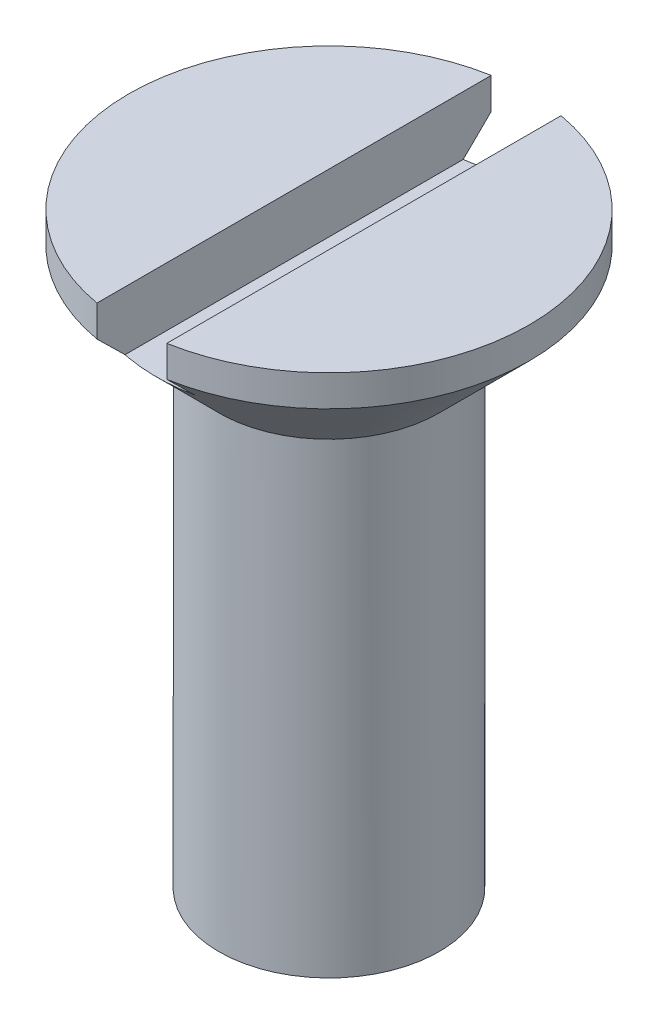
from build123d import *

# Parameters (mm, degrees)
CUT_EXTRUDE1_DEPTH      = 20.334700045
CUT_EXTRUDE1_DEPTH_BACK = 20.334700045
SKETCH2_W               = 1.9
SKETCH2_H               = 1.6


with BuildPart() as part:
    # Sketch1 → Revolve1 (revolve)
    with BuildSketch(Plane(origin=(0, 0, 0), x_dir=(1, 0, 0), z_dir=(0, 0, -1)), mode=Mode.PRIVATE) as revolve1_sk:
        Polygon((3, -14.432050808), (5.45, -16.882050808), (5.45, -17.732050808), (0, -17.732050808), (0, 0), (3, -1.732050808), align=None)
    revolve(revolve1_sk.sketch.rotate(Axis((0, 0, 0), (0, 1, 0)), 90), axis=Axis((0, 0, 0), (0, 1, 0)))

    # Sketch2 → Cut-Extrude1 (cut, two sides: drawn at the far end of the back side and taken through both)
    with BuildSketch(Plane.XY.offset(-CUT_EXTRUDE1_DEPTH_BACK)):
        with Locations((0, 16.932050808)):
            Rectangle(SKETCH2_W, SKETCH2_H)
    extrude(amount=CUT_EXTRUDE1_DEPTH + CUT_EXTRUDE1_DEPTH_BACK, mode=Mode.SUBTRACT)


solid = part.part
